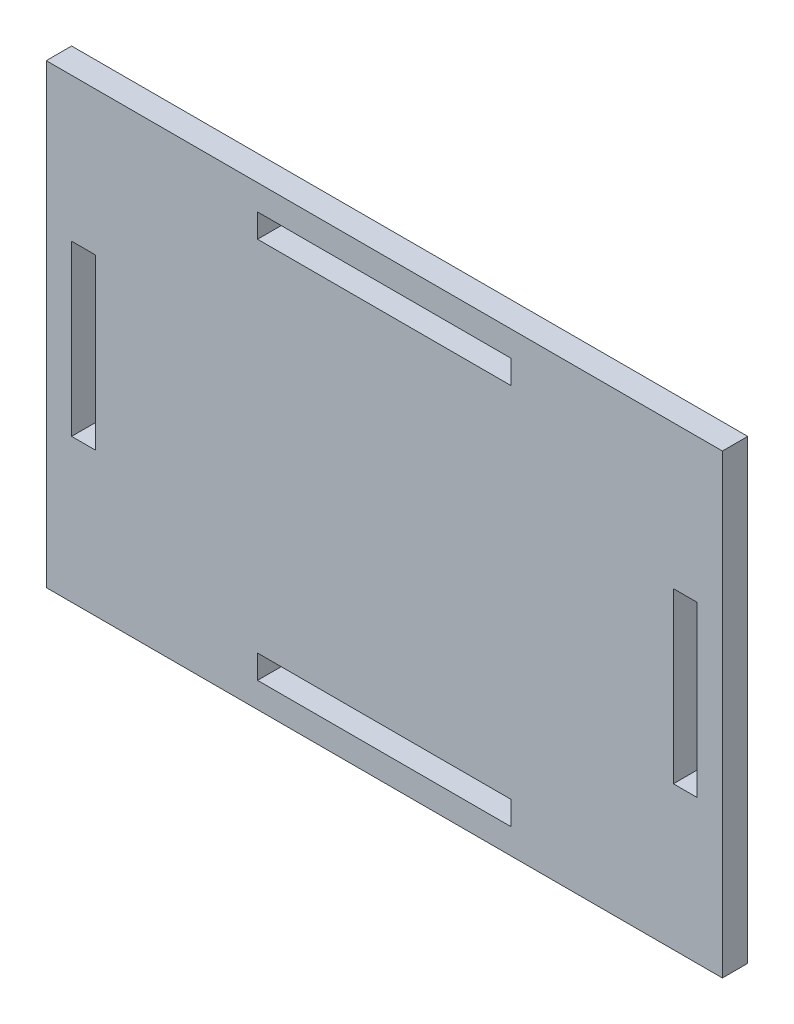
from build123d import *

# Parameters (mm, degrees)
CROQUIS1_W              = 80
CROQUIS1_H              = 54
CROQUIS1_W_2            = 30
CROQUIS1_H_2            = 2.8
CROQUIS1_W_3            = 2.8
CROQUIS1_H_3            = 20
SALIENTE_EXTRUIR1_DEPTH = 3


with BuildPart() as part:
    # Croquis1 → Saliente-Extruir1 (new body)
    with BuildSketch(Plane.XY):
        Rectangle(CROQUIS1_W, CROQUIS1_H)
        with Locations((0, 22.6)):
            Rectangle(CROQUIS1_W_2, CROQUIS1_H_2, mode=Mode.SUBTRACT)
        with Locations((-35.6, 0)):
            Rectangle(CROQUIS1_W_3, CROQUIS1_H_3, mode=Mode.SUBTRACT)
        with Locations((0, -22.6)):
            Rectangle(CROQUIS1_W_2, CROQUIS1_H_2, mode=Mode.SUBTRACT)
        with Locations((35.6, 0)):
            Rectangle(CROQUIS1_W_3, CROQUIS1_H_3, mode=Mode.SUBTRACT)
    extrude(amount=SALIENTE_EXTRUIR1_DEPTH)


solid = part.part
